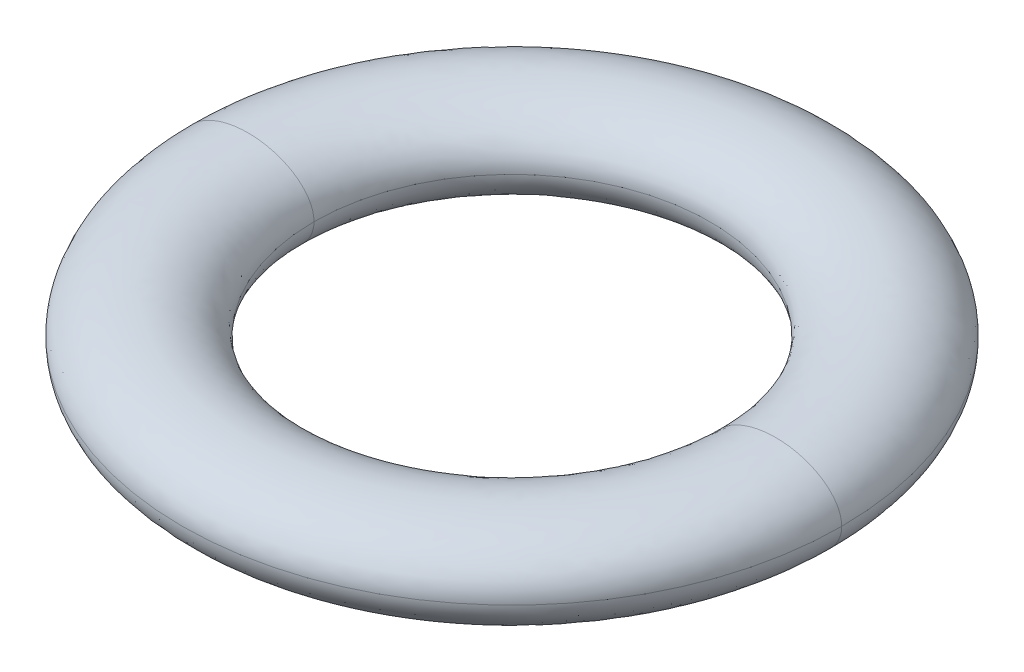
ISO-10303-21;
HEADER;
FILE_DESCRIPTION(('STEP AP214'),'2;1');
FILE_NAME('part.step','',(''),(''),'','','');
FILE_SCHEMA(('AUTOMOTIVE_DESIGN { 1 0 10303 214 1 1 1 1 }'));
ENDSEC;
DATA;
#1=APPLICATION_CONTEXT('core data for automotive mechanical design processes');
#2=APPLICATION_PROTOCOL_DEFINITION('international standard','automotive_design',2000,#1);
#3=PRODUCT_CONTEXT('',#1,'mechanical');
#4=PRODUCT('Part','Part','',(#3));
#5=PRODUCT_RELATED_PRODUCT_CATEGORY('part','',(#4));
#6=PRODUCT_DEFINITION_FORMATION('','',#4);
#7=PRODUCT_DEFINITION_CONTEXT('part definition',#1,'design');
#8=PRODUCT_DEFINITION('design','',#6,#7);
#9=PRODUCT_DEFINITION_SHAPE('','',#8);
#10=(LENGTH_UNIT() NAMED_UNIT(*) SI_UNIT(.MILLI.,.METRE.));
#11=(NAMED_UNIT(*) PLANE_ANGLE_UNIT() SI_UNIT($,.RADIAN.));
#12=(NAMED_UNIT(*) SI_UNIT($,.STERADIAN.) SOLID_ANGLE_UNIT());
#13=UNCERTAINTY_MEASURE_WITH_UNIT(LENGTH_MEASURE(1.E-05),#10,'distance_accuracy_value','');
#14=(GEOMETRIC_REPRESENTATION_CONTEXT(3) GLOBAL_UNCERTAINTY_ASSIGNED_CONTEXT((#13)) GLOBAL_UNIT_ASSIGNED_CONTEXT((#10,
#11,#12)) REPRESENTATION_CONTEXT('',''));
#15=CARTESIAN_POINT('',(0.,0.,0.));
#16=DIRECTION('',(0.,0.,1.));
#17=DIRECTION('',(1.,0.,0.));
#18=AXIS2_PLACEMENT_3D('',#15,#16,#17);
#19=CARTESIAN_POINT('',(9.005208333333,-76.,0.));
#20=CARTESIAN_POINT('',(9.005208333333,-76.,18.010416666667));
#21=CARTESIAN_POINT('',(-9.005208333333,-76.,18.010416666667));
#22=CARTESIAN_POINT('',(-9.005208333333,-76.,0.));
#23=CARTESIAN_POINT('',(9.005208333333,-80.,0.));
#24=CARTESIAN_POINT('',(9.005208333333,-80.,18.010416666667));
#25=CARTESIAN_POINT('',(-9.005208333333,-80.,18.010416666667));
#26=CARTESIAN_POINT('',(-9.005208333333,-80.,0.));
#27=CARTESIAN_POINT('',(14.994791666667,-80.,0.));
#28=CARTESIAN_POINT('',(14.994791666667,-80.,29.989583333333));
#29=CARTESIAN_POINT('',(-14.99479166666,-80.,29.989583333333));
#30=CARTESIAN_POINT('',(-14.99479166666,-80.,0.));
#31=CARTESIAN_POINT('',(14.994791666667,-76.,0.));
#32=CARTESIAN_POINT('',(14.994791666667,-76.,29.989583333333));
#33=CARTESIAN_POINT('',(-14.99479166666,-76.,29.989583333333));
#34=CARTESIAN_POINT('',(-14.99479166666,-76.,0.));
#35=(BOUNDED_SURFACE() B_SPLINE_SURFACE(3,3,((#19,#20,#21,#22),(#23,#24,#25,#26),(#27,#28,#29,
#30),(#31,#32,#33,#34)),.UNSPECIFIED.,.F.,.F.,.F.) B_SPLINE_SURFACE_WITH_KNOTS((4,4),(4,4),(0.,
1.),(0.,1.),.UNSPECIFIED.) GEOMETRIC_REPRESENTATION_ITEM() RATIONAL_B_SPLINE_SURFACE(((1.,
0.333333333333,0.333333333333,1.),(0.333333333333,0.111111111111,0.111111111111,0.333333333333),
(0.333333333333,0.111111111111,0.111111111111,0.333333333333),(1.,0.333333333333,0.333333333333,1.))) REPRESENTATION_ITEM('') SURFACE());
#36=CARTESIAN_POINT('',(-9.005208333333,-76.,0.));
#37=CARTESIAN_POINT('',(-9.005208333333,-80.,0.));
#38=CARTESIAN_POINT('',(-14.99479166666,-80.,0.));
#39=CARTESIAN_POINT('',(-14.99479166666,-76.,0.));
#40=(BOUNDED_CURVE() B_SPLINE_CURVE(3,(#36,#37,#38,#39),.UNSPECIFIED.,.F.,
.F.) B_SPLINE_CURVE_WITH_KNOTS((4,4),(3.14159265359,6.28318530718),
.UNSPECIFIED.) CURVE() GEOMETRIC_REPRESENTATION_ITEM() RATIONAL_B_SPLINE_CURVE((1.,
0.333333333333,0.333333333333,1.)) REPRESENTATION_ITEM(''));
#41=CARTESIAN_POINT('',(-9.005208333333,-76.,0.));
#42=VERTEX_POINT('',#41);
#43=CARTESIAN_POINT('',(-14.99479166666,-76.,0.));
#44=VERTEX_POINT('',#43);
#45=EDGE_CURVE('E72',#42,#44,#40,.T.);
#46=CARTESIAN_POINT('',(0.,-76.,0.));
#47=DIRECTION('',(0.,-1.,0.));
#48=DIRECTION('',(1.,0.,0.));
#49=AXIS2_PLACEMENT_3D('',#46,#47,#48);
#50=CIRCLE('',#49,9.005208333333);
#51=CARTESIAN_POINT('',(9.005208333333,-76.,0.));
#52=VERTEX_POINT('',#51);
#53=EDGE_CURVE('E10',#52,#42,#50,.T.);
#54=CARTESIAN_POINT('',(9.005208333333,-76.,0.));
#55=CARTESIAN_POINT('',(9.005208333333,-80.,0.));
#56=CARTESIAN_POINT('',(14.994791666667,-80.,0.));
#57=CARTESIAN_POINT('',(14.994791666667,-76.,0.));
#58=(BOUNDED_CURVE() B_SPLINE_CURVE(3,(#54,#55,#56,#57),.UNSPECIFIED.,.F.,
.F.) B_SPLINE_CURVE_WITH_KNOTS((4,4),(3.14159265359,6.28318530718),
.UNSPECIFIED.) CURVE() GEOMETRIC_REPRESENTATION_ITEM() RATIONAL_B_SPLINE_CURVE((1.,
0.333333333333,0.333333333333,1.)) REPRESENTATION_ITEM(''));
#59=CARTESIAN_POINT('',(14.994791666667,-76.,0.));
#60=VERTEX_POINT('',#59);
#61=EDGE_CURVE('E70',#52,#60,#58,.T.);
#62=CARTESIAN_POINT('',(0.,-76.,0.));
#63=DIRECTION('',(0.,-1.,0.));
#64=DIRECTION('',(1.,0.,0.));
#65=AXIS2_PLACEMENT_3D('',#62,#63,#64);
#66=CIRCLE('',#65,14.994791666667);
#67=EDGE_CURVE('E30',#60,#44,#66,.T.);
#68=ORIENTED_EDGE('',*,*,#45,.F.);
#69=ORIENTED_EDGE('',*,*,#53,.F.);
#70=ORIENTED_EDGE('',*,*,#61,.T.);
#71=ORIENTED_EDGE('',*,*,#67,.T.);
#72=EDGE_LOOP('',(#68,#69,#70,#71));
#73=FACE_BOUND('',#72,.T.);
#74=ADVANCED_FACE('F16',(#73),#35,.T.);
#75=CARTESIAN_POINT('',(14.994791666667,-76.,0.));
#76=CARTESIAN_POINT('',(14.994791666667,-76.,29.989583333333));
#77=CARTESIAN_POINT('',(-14.99479166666,-76.,29.989583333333));
#78=CARTESIAN_POINT('',(-14.99479166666,-76.,0.));
#79=CARTESIAN_POINT('',(14.994791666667,-72.,0.));
#80=CARTESIAN_POINT('',(14.994791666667,-72.,29.989583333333));
#81=CARTESIAN_POINT('',(-14.99479166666,-72.,29.989583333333));
#82=CARTESIAN_POINT('',(-14.99479166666,-72.,0.));
#83=CARTESIAN_POINT('',(9.005208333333,-72.,0.));
#84=CARTESIAN_POINT('',(9.005208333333,-72.,18.010416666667));
#85=CARTESIAN_POINT('',(-9.005208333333,-72.,18.010416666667));
#86=CARTESIAN_POINT('',(-9.005208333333,-72.,0.));
#87=CARTESIAN_POINT('',(9.005208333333,-76.,0.));
#88=CARTESIAN_POINT('',(9.005208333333,-76.,18.010416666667));
#89=CARTESIAN_POINT('',(-9.005208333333,-76.,18.010416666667));
#90=CARTESIAN_POINT('',(-9.005208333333,-76.,0.));
#91=(BOUNDED_SURFACE() B_SPLINE_SURFACE(3,3,((#75,#76,#77,#78),(#79,#80,#81,#82),(#83,#84,#85,
#86),(#87,#88,#89,#90)),.UNSPECIFIED.,.F.,.F.,.F.) B_SPLINE_SURFACE_WITH_KNOTS((4,4),(4,4),(0.,
1.),(0.,1.),.UNSPECIFIED.) GEOMETRIC_REPRESENTATION_ITEM() RATIONAL_B_SPLINE_SURFACE(((1.,
0.333333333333,0.333333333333,1.),(0.333333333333,0.111111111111,0.111111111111,0.333333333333),
(0.333333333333,0.111111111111,0.111111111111,0.333333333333),(1.,0.333333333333,0.333333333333,1.))) REPRESENTATION_ITEM('') SURFACE());
#92=CARTESIAN_POINT('',(-14.99479166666,-76.,0.));
#93=CARTESIAN_POINT('',(-14.99479166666,-72.,0.));
#94=CARTESIAN_POINT('',(-9.005208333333,-72.,0.));
#95=CARTESIAN_POINT('',(-9.005208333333,-76.,0.));
#96=(BOUNDED_CURVE() B_SPLINE_CURVE(3,(#92,#93,#94,#95),.UNSPECIFIED.,.F.,
.F.) B_SPLINE_CURVE_WITH_KNOTS((4,4),(0.,3.14159265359),
.UNSPECIFIED.) CURVE() GEOMETRIC_REPRESENTATION_ITEM() RATIONAL_B_SPLINE_CURVE((1.,
0.333333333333,0.333333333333,1.)) REPRESENTATION_ITEM(''));
#97=EDGE_CURVE('E59',#44,#42,#96,.T.);
#98=CARTESIAN_POINT('',(14.994791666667,-76.,0.));
#99=CARTESIAN_POINT('',(14.994791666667,-72.,0.));
#100=CARTESIAN_POINT('',(9.005208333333,-72.,0.));
#101=CARTESIAN_POINT('',(9.005208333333,-76.,0.));
#102=(BOUNDED_CURVE() B_SPLINE_CURVE(3,(#98,#99,#100,#101),.UNSPECIFIED.,.F.,
.F.) B_SPLINE_CURVE_WITH_KNOTS((4,4),(0.,3.14159265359),
.UNSPECIFIED.) CURVE() GEOMETRIC_REPRESENTATION_ITEM() RATIONAL_B_SPLINE_CURVE((1.,
0.333333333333,0.333333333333,1.)) REPRESENTATION_ITEM(''));
#103=EDGE_CURVE('E22',#60,#52,#102,.T.);
#104=ORIENTED_EDGE('',*,*,#97,.F.);
#105=ORIENTED_EDGE('',*,*,#67,.F.);
#106=ORIENTED_EDGE('',*,*,#103,.T.);
#107=ORIENTED_EDGE('',*,*,#53,.T.);
#108=EDGE_LOOP('',(#104,#105,#106,#107));
#109=FACE_BOUND('',#108,.T.);
#110=ADVANCED_FACE('F58',(#109),#91,.T.);
#111=CARTESIAN_POINT('',(-14.99479166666,-76.,0.));
#112=CARTESIAN_POINT('',(-14.99479166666,-76.,-29.98958333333));
#113=CARTESIAN_POINT('',(14.994791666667,-76.,-29.98958333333));
#114=CARTESIAN_POINT('',(14.994791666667,-76.,0.));
#115=CARTESIAN_POINT('',(-14.99479166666,-72.,0.));
#116=CARTESIAN_POINT('',(-14.99479166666,-72.,-29.98958333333));
#117=CARTESIAN_POINT('',(14.994791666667,-72.,-29.98958333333));
#118=CARTESIAN_POINT('',(14.994791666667,-72.,0.));
#119=CARTESIAN_POINT('',(-9.005208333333,-72.,0.));
#120=CARTESIAN_POINT('',(-9.005208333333,-72.,-18.01041666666));
#121=CARTESIAN_POINT('',(9.005208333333,-72.,-18.01041666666));
#122=CARTESIAN_POINT('',(9.005208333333,-72.,0.));
#123=CARTESIAN_POINT('',(-9.005208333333,-76.,0.));
#124=CARTESIAN_POINT('',(-9.005208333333,-76.,-18.01041666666));
#125=CARTESIAN_POINT('',(9.005208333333,-76.,-18.01041666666));
#126=CARTESIAN_POINT('',(9.005208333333,-76.,0.));
#127=(BOUNDED_SURFACE() B_SPLINE_SURFACE(3,3,((#111,#112,#113,#114),(#115,#116,#117,#118),(#119,
#120,#121,#122),(#123,#124,#125,#126)),.UNSPECIFIED.,.F.,.F.,
.F.) B_SPLINE_SURFACE_WITH_KNOTS((4,4),(4,4),(0.,1.),(0.,1.),
.UNSPECIFIED.) GEOMETRIC_REPRESENTATION_ITEM() RATIONAL_B_SPLINE_SURFACE(((1.,0.333333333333,
0.333333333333,1.),(0.333333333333,0.111111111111,0.111111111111,0.333333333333),
(0.333333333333,0.111111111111,0.111111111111,0.333333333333),(1.,0.333333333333,0.333333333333,1.))) REPRESENTATION_ITEM('') SURFACE());
#128=CARTESIAN_POINT('',(0.,-76.,0.));
#129=DIRECTION('',(0.,-1.,0.));
#130=DIRECTION('',(1.,0.,0.));
#131=AXIS2_PLACEMENT_3D('',#128,#129,#130);
#132=CIRCLE('',#131,14.994791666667);
#133=EDGE_CURVE('E67',#44,#60,#132,.T.);
#134=CARTESIAN_POINT('',(0.,-76.,0.));
#135=DIRECTION('',(0.,-1.,0.));
#136=DIRECTION('',(1.,0.,0.));
#137=AXIS2_PLACEMENT_3D('',#134,#135,#136);
#138=CIRCLE('',#137,9.005208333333);
#139=EDGE_CURVE('E65',#42,#52,#138,.T.);
#140=ORIENTED_EDGE('',*,*,#133,.F.);
#141=ORIENTED_EDGE('',*,*,#97,.T.);
#142=ORIENTED_EDGE('',*,*,#139,.T.);
#143=ORIENTED_EDGE('',*,*,#103,.F.);
#144=EDGE_LOOP('',(#140,#141,#142,#143));
#145=FACE_BOUND('',#144,.T.);
#146=ADVANCED_FACE('F18',(#145),#127,.T.);
#147=CARTESIAN_POINT('',(-9.005208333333,-76.,0.));
#148=CARTESIAN_POINT('',(-9.005208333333,-76.,-18.01041666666));
#149=CARTESIAN_POINT('',(9.005208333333,-76.,-18.01041666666));
#150=CARTESIAN_POINT('',(9.005208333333,-76.,0.));
#151=CARTESIAN_POINT('',(-9.005208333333,-80.,0.));
#152=CARTESIAN_POINT('',(-9.005208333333,-80.,-18.01041666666));
#153=CARTESIAN_POINT('',(9.005208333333,-80.,-18.01041666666));
#154=CARTESIAN_POINT('',(9.005208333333,-80.,0.));
#155=CARTESIAN_POINT('',(-14.99479166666,-80.,0.));
#156=CARTESIAN_POINT('',(-14.99479166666,-80.,-29.98958333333));
#157=CARTESIAN_POINT('',(14.994791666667,-80.,-29.98958333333));
#158=CARTESIAN_POINT('',(14.994791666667,-80.,0.));
#159=CARTESIAN_POINT('',(-14.99479166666,-76.,0.));
#160=CARTESIAN_POINT('',(-14.99479166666,-76.,-29.98958333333));
#161=CARTESIAN_POINT('',(14.994791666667,-76.,-29.98958333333));
#162=CARTESIAN_POINT('',(14.994791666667,-76.,0.));
#163=(BOUNDED_SURFACE() B_SPLINE_SURFACE(3,3,((#147,#148,#149,#150),(#151,#152,#153,#154),(#155,
#156,#157,#158),(#159,#160,#161,#162)),.UNSPECIFIED.,.F.,.F.,
.F.) B_SPLINE_SURFACE_WITH_KNOTS((4,4),(4,4),(0.,1.),(0.,1.),
.UNSPECIFIED.) GEOMETRIC_REPRESENTATION_ITEM() RATIONAL_B_SPLINE_SURFACE(((1.,0.333333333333,
0.333333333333,1.),(0.333333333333,0.111111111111,0.111111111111,0.333333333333),
(0.333333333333,0.111111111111,0.111111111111,0.333333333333),(1.,0.333333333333,0.333333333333,1.))) REPRESENTATION_ITEM('') SURFACE());
#164=ORIENTED_EDGE('',*,*,#139,.F.);
#165=ORIENTED_EDGE('',*,*,#45,.T.);
#166=ORIENTED_EDGE('',*,*,#133,.T.);
#167=ORIENTED_EDGE('',*,*,#61,.F.);
#168=EDGE_LOOP('',(#164,#165,#166,#167));
#169=FACE_BOUND('',#168,.T.);
#170=ADVANCED_FACE('F76',(#169),#163,.T.);
#171=CLOSED_SHELL('',(#74,#110,#146,#170));
#172=MANIFOLD_SOLID_BREP('B1',#171);
#173=ADVANCED_BREP_SHAPE_REPRESENTATION('',(#18,#172),#14);
#174=SHAPE_DEFINITION_REPRESENTATION(#9,#173);
ENDSEC;
END-ISO-10303-21;
